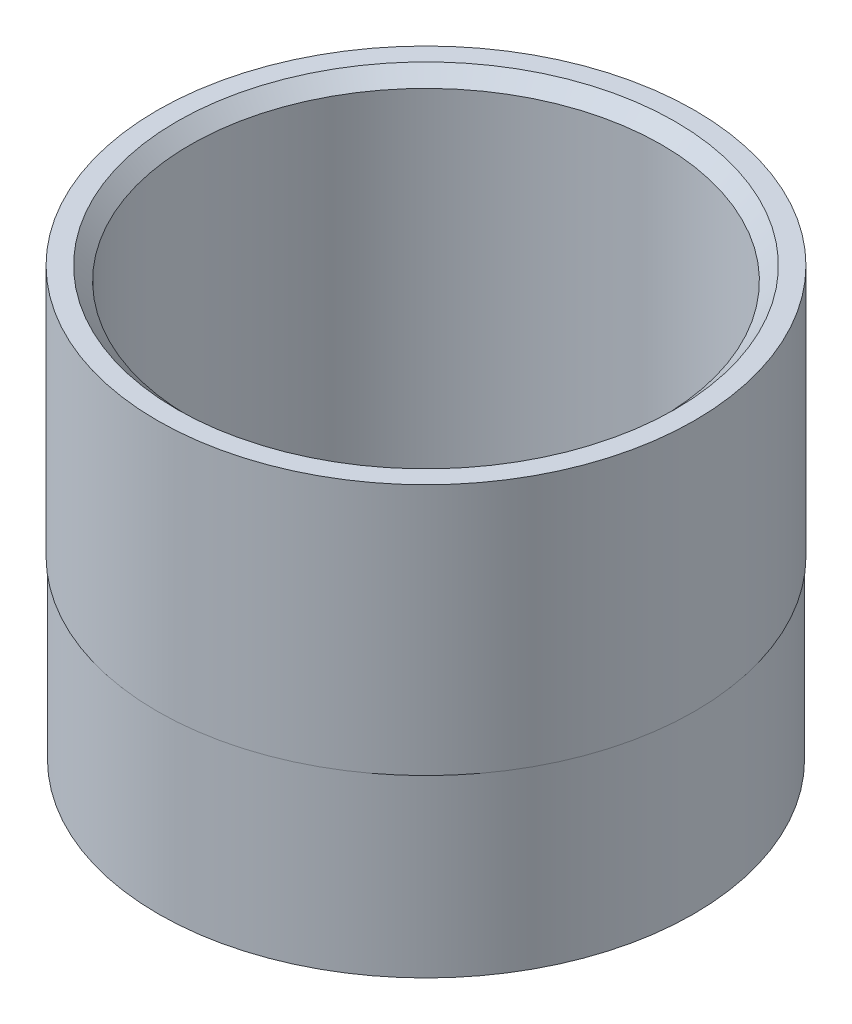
ISO-10303-21;
HEADER;
FILE_DESCRIPTION(('STEP AP214'),'2;1');
FILE_NAME('part.step','',(''),(''),'','','');
FILE_SCHEMA(('AUTOMOTIVE_DESIGN { 1 0 10303 214 1 1 1 1 }'));
ENDSEC;
DATA;
#1=APPLICATION_CONTEXT('core data for automotive mechanical design processes');
#2=APPLICATION_PROTOCOL_DEFINITION('international standard','automotive_design',2000,#1);
#3=PRODUCT_CONTEXT('',#1,'mechanical');
#4=PRODUCT('Part','Part','',(#3));
#5=PRODUCT_RELATED_PRODUCT_CATEGORY('part','',(#4));
#6=PRODUCT_DEFINITION_FORMATION('','',#4);
#7=PRODUCT_DEFINITION_CONTEXT('part definition',#1,'design');
#8=PRODUCT_DEFINITION('design','',#6,#7);
#9=PRODUCT_DEFINITION_SHAPE('','',#8);
#10=(LENGTH_UNIT() NAMED_UNIT(*) SI_UNIT(.MILLI.,.METRE.));
#11=(NAMED_UNIT(*) PLANE_ANGLE_UNIT() SI_UNIT($,.RADIAN.));
#12=(NAMED_UNIT(*) SI_UNIT($,.STERADIAN.) SOLID_ANGLE_UNIT());
#13=UNCERTAINTY_MEASURE_WITH_UNIT(LENGTH_MEASURE(1.E-05),#10,'distance_accuracy_value','');
#14=(GEOMETRIC_REPRESENTATION_CONTEXT(3) GLOBAL_UNCERTAINTY_ASSIGNED_CONTEXT((#13)) GLOBAL_UNIT_ASSIGNED_CONTEXT((#10,
#11,#12)) REPRESENTATION_CONTEXT('',''));
#15=CARTESIAN_POINT('',(0.,0.,0.));
#16=DIRECTION('',(0.,0.,1.));
#17=DIRECTION('',(1.,0.,0.));
#18=AXIS2_PLACEMENT_3D('',#15,#16,#17);
#19=CARTESIAN_POINT('',(0.,0.,0.));
#20=DIRECTION('',(0.,-1.,0.));
#21=DIRECTION('',(0.,0.,-1.));
#22=AXIS2_PLACEMENT_3D('',#19,#20,#21);
#23=CYLINDRICAL_SURFACE('',#22,50.6095);
#24=CARTESIAN_POINT('',(0.,0.,0.));
#25=DIRECTION('',(0.,-1.,0.));
#26=DIRECTION('',(0.,0.,-1.));
#27=AXIS2_PLACEMENT_3D('',#24,#25,#26);
#28=CIRCLE('',#27,50.6095);
#29=CARTESIAN_POINT('',(0.,0.,-50.6095));
#30=VERTEX_POINT('',#29);
#31=EDGE_CURVE('E48',#30,#30,#28,.T.);
#32=ORIENTED_EDGE('',*,*,#31,.F.);
#33=EDGE_LOOP('',(#32));
#34=FACE_BOUND('',#33,.T.);
#35=CARTESIAN_POINT('',(0.,33.274,0.));
#36=DIRECTION('',(0.,1.,0.));
#37=DIRECTION('',(0.,0.,1.));
#38=AXIS2_PLACEMENT_3D('',#35,#36,#37);
#39=CIRCLE('',#38,50.6095);
#40=CARTESIAN_POINT('',(0.,33.274,50.6095));
#41=VERTEX_POINT('',#40);
#42=EDGE_CURVE('E60',#41,#41,#39,.T.);
#43=ORIENTED_EDGE('',*,*,#42,.F.);
#44=EDGE_LOOP('',(#43));
#45=FACE_BOUND('',#44,.T.);
#46=ADVANCED_FACE('F33',(#34,#45),#23,.T.);
#47=CARTESIAN_POINT('',(0.,2.54,0.));
#48=DIRECTION('',(0.,-1.,0.));
#49=DIRECTION('',(0.,0.,-1.));
#50=AXIS2_PLACEMENT_3D('',#47,#48,#49);
#51=CONICAL_SURFACE('',#50,44.577,0.785398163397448);
#52=CARTESIAN_POINT('',(0.,0.,0.));
#53=DIRECTION('',(0.,-1.,0.));
#54=DIRECTION('',(0.,0.,-1.));
#55=AXIS2_PLACEMENT_3D('',#52,#53,#54);
#56=CIRCLE('',#55,47.117);
#57=CARTESIAN_POINT('',(0.,0.,-47.117));
#58=VERTEX_POINT('',#57);
#59=EDGE_CURVE('E53',#58,#58,#56,.T.);
#60=ORIENTED_EDGE('',*,*,#59,.T.);
#61=EDGE_LOOP('',(#60));
#62=FACE_BOUND('',#61,.T.);
#63=CARTESIAN_POINT('',(0.,2.54,0.));
#64=DIRECTION('',(0.,-1.,0.));
#65=DIRECTION('',(0.,0.,-1.));
#66=AXIS2_PLACEMENT_3D('',#63,#64,#65);
#67=CIRCLE('',#66,44.577);
#68=CARTESIAN_POINT('',(0.,2.54,-44.577));
#69=VERTEX_POINT('',#68);
#70=EDGE_CURVE('E10',#69,#69,#67,.T.);
#71=ORIENTED_EDGE('',*,*,#70,.F.);
#72=EDGE_LOOP('',(#71));
#73=FACE_BOUND('',#72,.T.);
#74=ADVANCED_FACE('F35',(#62,#73),#51,.F.);
#75=CARTESIAN_POINT('',(0.,0.,0.));
#76=DIRECTION('',(0.,-1.,0.));
#77=DIRECTION('',(0.,0.,-1.));
#78=AXIS2_PLACEMENT_3D('',#75,#76,#77);
#79=CYLINDRICAL_SURFACE('',#78,44.577);
#80=CARTESIAN_POINT('',(0.,78.359,0.));
#81=DIRECTION('',(0.,-1.,0.));
#82=DIRECTION('',(0.,0.,-1.));
#83=AXIS2_PLACEMENT_3D('',#80,#81,#82);
#84=CIRCLE('',#83,44.577);
#85=CARTESIAN_POINT('',(0.,78.359,-44.577));
#86=VERTEX_POINT('',#85);
#87=EDGE_CURVE('E40',#86,#86,#84,.T.);
#88=ORIENTED_EDGE('',*,*,#87,.F.);
#89=EDGE_LOOP('',(#88));
#90=FACE_BOUND('',#89,.T.);
#91=ORIENTED_EDGE('',*,*,#70,.T.);
#92=EDGE_LOOP('',(#91));
#93=FACE_BOUND('',#92,.T.);
#94=ADVANCED_FACE('F75',(#90,#93),#79,.F.);
#95=CARTESIAN_POINT('',(0.,78.359,0.));
#96=DIRECTION('',(0.,1.,0.));
#97=DIRECTION('',(0.,0.,1.));
#98=AXIS2_PLACEMENT_3D('',#95,#96,#97);
#99=CONICAL_SURFACE('',#98,44.577,0.785398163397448);
#100=CARTESIAN_POINT('',(0.,80.899,0.));
#101=DIRECTION('',(0.,-1.,0.));
#102=DIRECTION('',(0.,0.,-1.));
#103=AXIS2_PLACEMENT_3D('',#100,#101,#102);
#104=CIRCLE('',#103,47.117);
#105=CARTESIAN_POINT('',(0.,80.899,-47.117));
#106=VERTEX_POINT('',#105);
#107=EDGE_CURVE('E44',#106,#106,#104,.T.);
#108=ORIENTED_EDGE('',*,*,#107,.F.);
#109=EDGE_LOOP('',(#108));
#110=FACE_BOUND('',#109,.T.);
#111=ORIENTED_EDGE('',*,*,#87,.T.);
#112=EDGE_LOOP('',(#111));
#113=FACE_BOUND('',#112,.T.);
#114=ADVANCED_FACE('F85',(#110,#113),#99,.F.);
#115=CARTESIAN_POINT('',(0.,80.899,0.));
#116=DIRECTION('',(0.,-1.,0.));
#117=DIRECTION('',(0.,0.,-1.));
#118=AXIS2_PLACEMENT_3D('',#115,#116,#117);
#119=PLANE('',#118);
#120=ORIENTED_EDGE('',*,*,#107,.T.);
#121=EDGE_LOOP('',(#120));
#122=FACE_BOUND('',#121,.T.);
#123=CARTESIAN_POINT('',(0.,80.899,0.));
#124=DIRECTION('',(0.,1.,0.));
#125=DIRECTION('',(0.,0.,1.));
#126=AXIS2_PLACEMENT_3D('',#123,#124,#125);
#127=CIRCLE('',#126,50.8);
#128=CARTESIAN_POINT('',(0.,80.899,50.8));
#129=VERTEX_POINT('',#128);
#130=EDGE_CURVE('E57',#129,#129,#127,.T.);
#131=ORIENTED_EDGE('',*,*,#130,.T.);
#132=EDGE_LOOP('',(#131));
#133=FACE_BOUND('',#132,.T.);
#134=ADVANCED_FACE('F82',(#122,#133),#119,.F.);
#135=CARTESIAN_POINT('',(0.,0.,0.));
#136=DIRECTION('',(0.,-1.,0.));
#137=DIRECTION('',(0.,0.,-1.));
#138=AXIS2_PLACEMENT_3D('',#135,#136,#137);
#139=PLANE('',#138);
#140=ORIENTED_EDGE('',*,*,#31,.T.);
#141=EDGE_LOOP('',(#140));
#142=FACE_BOUND('',#141,.T.);
#143=ORIENTED_EDGE('',*,*,#59,.F.);
#144=EDGE_LOOP('',(#143));
#145=FACE_BOUND('',#144,.T.);
#146=ADVANCED_FACE('F80',(#142,#145),#139,.T.);
#147=CARTESIAN_POINT('',(0.,33.274,0.));
#148=DIRECTION('',(0.,1.,0.));
#149=DIRECTION('',(0.,0.,1.));
#150=AXIS2_PLACEMENT_3D('',#147,#148,#149);
#151=CYLINDRICAL_SURFACE('',#150,50.8);
#152=CARTESIAN_POINT('',(0.,33.274,0.));
#153=DIRECTION('',(0.,1.,0.));
#154=DIRECTION('',(0.,0.,1.));
#155=AXIS2_PLACEMENT_3D('',#152,#153,#154);
#156=CIRCLE('',#155,50.8);
#157=CARTESIAN_POINT('',(0.,33.274,50.8));
#158=VERTEX_POINT('',#157);
#159=EDGE_CURVE('E56',#158,#158,#156,.T.);
#160=ORIENTED_EDGE('',*,*,#159,.T.);
#161=EDGE_LOOP('',(#160));
#162=FACE_BOUND('',#161,.T.);
#163=ORIENTED_EDGE('',*,*,#130,.F.);
#164=EDGE_LOOP('',(#163));
#165=FACE_BOUND('',#164,.T.);
#166=ADVANCED_FACE('F110',(#162,#165),#151,.T.);
#167=CARTESIAN_POINT('',(0.,33.274,0.));
#168=DIRECTION('',(0.,1.,0.));
#169=DIRECTION('',(0.,0.,1.));
#170=AXIS2_PLACEMENT_3D('',#167,#168,#169);
#171=PLANE('',#170);
#172=ORIENTED_EDGE('',*,*,#42,.T.);
#173=EDGE_LOOP('',(#172));
#174=FACE_BOUND('',#173,.T.);
#175=ORIENTED_EDGE('',*,*,#159,.F.);
#176=EDGE_LOOP('',(#175));
#177=FACE_BOUND('',#176,.T.);
#178=ADVANCED_FACE('F66',(#174,#177),#171,.F.);
#179=CLOSED_SHELL('',(#46,#74,#94,#114,#134,#146,#166,#178));
#180=MANIFOLD_SOLID_BREP('B2',#179);
#181=ADVANCED_BREP_SHAPE_REPRESENTATION('',(#18,#180),#14);
#182=SHAPE_DEFINITION_REPRESENTATION(#9,#181);
ENDSEC;
END-ISO-10303-21;
